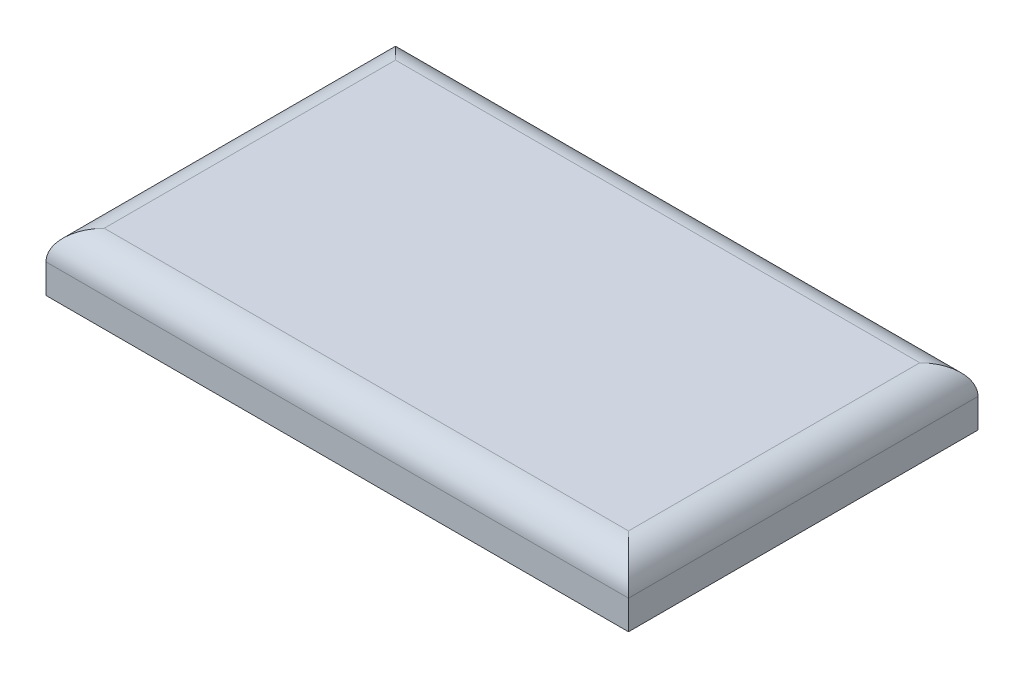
from build123d import *

# Parameters (mm, degrees)
SKETCH1_W      = 100
SKETCH1_H      = 60
EXTRUDE1_DEPTH = 10
FILLET1_R      = 5


with BuildPart() as part:
    # Sketch1 → Extrude1 (new body)
    with BuildSketch(Plane(origin=(0, 0, 0), x_dir=(1, 0, 0), z_dir=(0, 1, 0))):
        Rectangle(SKETCH1_W, SKETCH1_H)
    extrude(amount=EXTRUDE1_DEPTH)

    # Fillet1
    fillet1_edges = [part.edges().sort_by_distance(p)[0] for p in [
        (-50, 10, 0),
        (0, 10, 30),
        (50, 10, 0),
        (0, 10, -30),
    ]]
    fillet(fillet1_edges, radius=FILLET1_R)


solid = part.part
